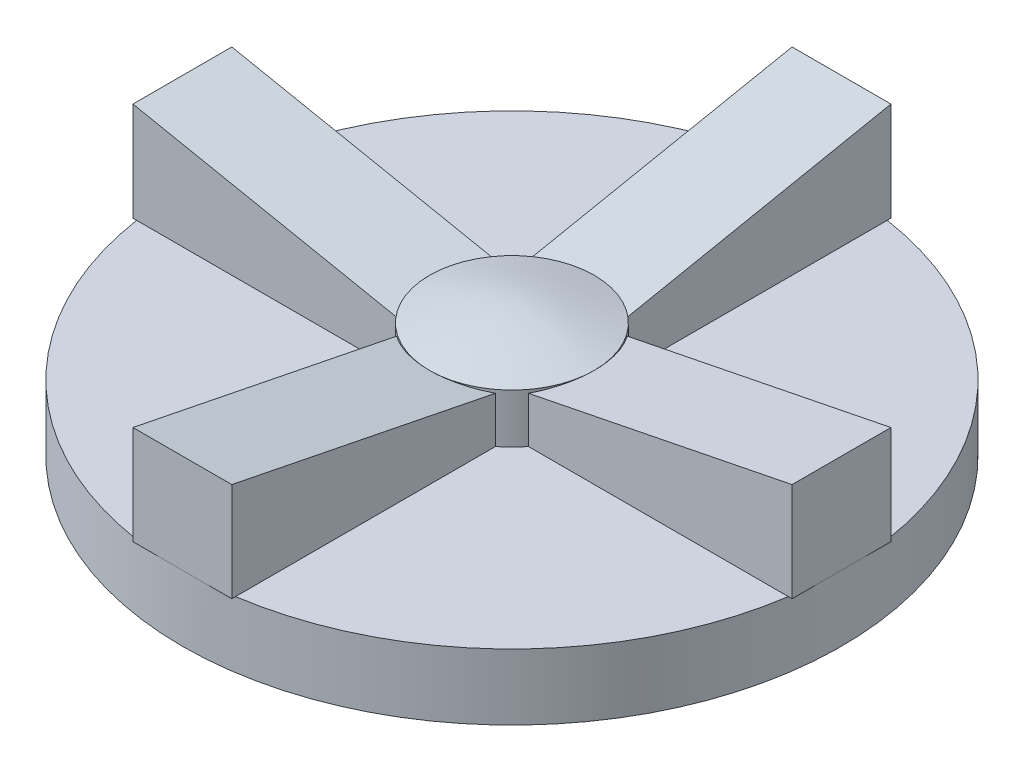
ISO-10303-21;
HEADER;
FILE_DESCRIPTION(('STEP AP214'),'2;1');
FILE_NAME('part.step','',(''),(''),'','','');
FILE_SCHEMA(('AUTOMOTIVE_DESIGN { 1 0 10303 214 1 1 1 1 }'));
ENDSEC;
DATA;
#1=APPLICATION_CONTEXT('core data for automotive mechanical design processes');
#2=APPLICATION_PROTOCOL_DEFINITION('international standard','automotive_design',2000,#1);
#3=PRODUCT_CONTEXT('',#1,'mechanical');
#4=PRODUCT('Part','Part','',(#3));
#5=PRODUCT_RELATED_PRODUCT_CATEGORY('part','',(#4));
#6=PRODUCT_DEFINITION_FORMATION('','',#4);
#7=PRODUCT_DEFINITION_CONTEXT('part definition',#1,'design');
#8=PRODUCT_DEFINITION('design','',#6,#7);
#9=PRODUCT_DEFINITION_SHAPE('','',#8);
#10=(LENGTH_UNIT() NAMED_UNIT(*) SI_UNIT(.MILLI.,.METRE.));
#11=(NAMED_UNIT(*) PLANE_ANGLE_UNIT() SI_UNIT($,.RADIAN.));
#12=(NAMED_UNIT(*) SI_UNIT($,.STERADIAN.) SOLID_ANGLE_UNIT());
#13=UNCERTAINTY_MEASURE_WITH_UNIT(LENGTH_MEASURE(1.E-05),#10,'distance_accuracy_value','');
#14=(GEOMETRIC_REPRESENTATION_CONTEXT(3) GLOBAL_UNCERTAINTY_ASSIGNED_CONTEXT((#13)) GLOBAL_UNIT_ASSIGNED_CONTEXT((#10,
#11,#12)) REPRESENTATION_CONTEXT('',''));
#15=CARTESIAN_POINT('',(0.,0.,0.));
#16=DIRECTION('',(0.,0.,1.));
#17=DIRECTION('',(1.,0.,0.));
#18=AXIS2_PLACEMENT_3D('',#15,#16,#17);
#19=CARTESIAN_POINT('',(0.,4.,0.));
#20=DIRECTION('',(0.,1.,0.));
#21=DIRECTION('',(0.,0.,1.));
#22=AXIS2_PLACEMENT_3D('',#19,#20,#21);
#23=PLANE('',#22);
#24=CARTESIAN_POINT('',(0.,4.,0.));
#25=DIRECTION('',(0.,1.,0.));
#26=DIRECTION('',(0.,0.,1.));
#27=AXIS2_PLACEMENT_3D('',#24,#25,#26);
#28=CIRCLE('',#27,5.);
#29=CARTESIAN_POINT('',(-2.99999999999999,4.,4.00000000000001));
#30=VERTEX_POINT('',#29);
#31=CARTESIAN_POINT('',(-4.,4.,3.));
#32=VERTEX_POINT('',#31);
#33=EDGE_CURVE('E178',#30,#32,#28,.F.);
#34=ORIENTED_EDGE('',*,*,#33,.T.);
#35=DIRECTION('',(1.,0.,0.));
#36=VECTOR('',#35,1.);
#37=CARTESIAN_POINT('',(-20.,4.,3.));
#38=LINE('',#37,#36);
#39=CARTESIAN_POINT('',(-19.7737199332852,4.,3.));
#40=VERTEX_POINT('',#39);
#41=EDGE_CURVE('E402',#40,#32,#38,.T.);
#42=ORIENTED_EDGE('',*,*,#41,.F.);
#43=CARTESIAN_POINT('',(0.,4.,0.));
#44=DIRECTION('',(0.,1.,0.));
#45=DIRECTION('',(0.,0.,1.));
#46=AXIS2_PLACEMENT_3D('',#43,#44,#45);
#47=CIRCLE('',#46,20.);
#48=CARTESIAN_POINT('',(-2.99999999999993,4.,19.7737199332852));
#49=VERTEX_POINT('',#48);
#50=EDGE_CURVE('E559',#40,#49,#47,.T.);
#51=ORIENTED_EDGE('',*,*,#50,.T.);
#52=DIRECTION('',(0.,0.,-1.));
#53=VECTOR('',#52,1.);
#54=CARTESIAN_POINT('',(-2.99999999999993,4.,20.));
#55=LINE('',#54,#53);
#56=EDGE_CURVE('E382',#49,#30,#55,.T.);
#57=ORIENTED_EDGE('',*,*,#56,.T.);
#58=EDGE_LOOP('',(#34,#42,#51,#57));
#59=FACE_BOUND('',#58,.T.);
#60=ADVANCED_FACE('F127',(#59),#23,.T.);
#61=CARTESIAN_POINT('',(-4.,4.,-3.));
#62=VERTEX_POINT('',#61);
#63=CARTESIAN_POINT('',(-3.00000000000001,4.,-3.99999999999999));
#64=VERTEX_POINT('',#63);
#65=EDGE_CURVE('E527',#62,#64,#28,.F.);
#66=ORIENTED_EDGE('',*,*,#65,.T.);
#67=CARTESIAN_POINT('',(-3.00000000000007,4.,-19.7737199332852));
#68=VERTEX_POINT('',#67);
#69=EDGE_CURVE('E383',#64,#68,#55,.T.);
#70=ORIENTED_EDGE('',*,*,#69,.T.);
#71=CARTESIAN_POINT('',(-19.7737199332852,4.,-3.));
#72=VERTEX_POINT('',#71);
#73=EDGE_CURVE('E312',#68,#72,#47,.T.);
#74=ORIENTED_EDGE('',*,*,#73,.T.);
#75=DIRECTION('',(1.,0.,0.));
#76=VECTOR('',#75,1.);
#77=CARTESIAN_POINT('',(-20.,4.,-3.));
#78=LINE('',#77,#76);
#79=EDGE_CURVE('E144',#72,#62,#78,.T.);
#80=ORIENTED_EDGE('',*,*,#79,.T.);
#81=EDGE_LOOP('',(#66,#70,#74,#80));
#82=FACE_BOUND('',#81,.T.);
#83=ADVANCED_FACE('F562',(#82),#23,.T.);
#84=CARTESIAN_POINT('',(4.00000000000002,4.,2.99999999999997));
#85=VERTEX_POINT('',#84);
#86=CARTESIAN_POINT('',(3.00000000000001,4.,3.99999999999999));
#87=VERTEX_POINT('',#86);
#88=EDGE_CURVE('E458',#85,#87,#28,.F.);
#89=ORIENTED_EDGE('',*,*,#88,.T.);
#90=DIRECTION('',(0.,0.,-1.));
#91=VECTOR('',#90,1.);
#92=CARTESIAN_POINT('',(3.00000000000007,4.,20.));
#93=LINE('',#92,#91);
#94=CARTESIAN_POINT('',(3.00000000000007,4.,19.7737199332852));
#95=VERTEX_POINT('',#94);
#96=EDGE_CURVE('E373',#95,#87,#93,.T.);
#97=ORIENTED_EDGE('',*,*,#96,.F.);
#98=CARTESIAN_POINT('',(19.7737199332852,4.,2.99999999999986));
#99=VERTEX_POINT('',#98);
#100=EDGE_CURVE('E576',#95,#99,#47,.T.);
#101=ORIENTED_EDGE('',*,*,#100,.T.);
#102=DIRECTION('',(-1.,0.,0.));
#103=VECTOR('',#102,1.);
#104=CARTESIAN_POINT('',(20.,4.,2.99999999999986));
#105=LINE('',#104,#103);
#106=EDGE_CURVE('E341',#99,#85,#105,.T.);
#107=ORIENTED_EDGE('',*,*,#106,.T.);
#108=EDGE_LOOP('',(#89,#97,#101,#107));
#109=FACE_BOUND('',#108,.T.);
#110=ADVANCED_FACE('F635',(#109),#23,.T.);
#111=CARTESIAN_POINT('',(0.,6.,3.));
#112=DIRECTION('',(-0.196116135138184,-0.98058067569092,0.));
#113=DIRECTION('',(0.98058067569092,-0.196116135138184,0.));
#114=AXIS2_PLACEMENT_3D('',#111,#112,#113);
#115=PLANE('',#114);
#116=CARTESIAN_POINT('',(0.,6.,0.));
#117=DIRECTION('',(-0.196116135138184,-0.98058067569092,0.));
#118=DIRECTION('',(-0.98058067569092,0.196116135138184,0.));
#119=AXIS2_PLACEMENT_3D('',#116,#117,#118);
#120=ELLIPSE('',#119,5.09901951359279,5.);
#121=CARTESIAN_POINT('',(-4.,6.8,3.));
#122=VERTEX_POINT('',#121);
#123=CARTESIAN_POINT('',(-4.99999933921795,7.00013642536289,1.80016049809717E-11));
#124=VERTEX_POINT('',#123);
#125=EDGE_CURVE('E453',#122,#124,#120,.T.);
#126=ORIENTED_EDGE('',*,*,#125,.T.);
#127=CARTESIAN_POINT('',(-4.,6.8,-3.));
#128=VERTEX_POINT('',#127);
#129=EDGE_CURVE('E444',#124,#128,#120,.T.);
#130=ORIENTED_EDGE('',*,*,#129,.T.);
#131=DIRECTION('',(-0.98058067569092,0.196116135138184,0.));
#132=VECTOR('',#131,1.);
#133=CARTESIAN_POINT('',(0.,6.,-3.));
#134=LINE('',#133,#132);
#135=CARTESIAN_POINT('',(-20.,10.,-3.));
#136=VERTEX_POINT('',#135);
#137=EDGE_CURVE('E410',#128,#136,#134,.T.);
#138=ORIENTED_EDGE('',*,*,#137,.T.);
#139=DIRECTION('',(0.,0.,-1.));
#140=VECTOR('',#139,1.);
#141=CARTESIAN_POINT('',(-20.,10.,3.));
#142=LINE('',#141,#140);
#143=CARTESIAN_POINT('',(-20.,10.,3.));
#144=VERTEX_POINT('',#143);
#145=EDGE_CURVE('E417',#144,#136,#142,.T.);
#146=ORIENTED_EDGE('',*,*,#145,.F.);
#147=DIRECTION('',(-0.98058067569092,0.196116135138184,0.));
#148=VECTOR('',#147,1.);
#149=CARTESIAN_POINT('',(0.,6.,3.));
#150=LINE('',#149,#148);
#151=EDGE_CURVE('E400',#122,#144,#150,.T.);
#152=ORIENTED_EDGE('',*,*,#151,.F.);
#153=EDGE_LOOP('',(#126,#130,#138,#146,#152));
#154=FACE_BOUND('',#153,.T.);
#155=ADVANCED_FACE('F495',(#154),#115,.F.);
#156=CARTESIAN_POINT('',(0.,4.,3.));
#157=DIRECTION('',(0.,0.,1.));
#158=DIRECTION('',(1.,0.,0.));
#159=AXIS2_PLACEMENT_3D('',#156,#157,#158);
#160=PLANE('',#159);
#161=DIRECTION('',(0.,1.,0.));
#162=VECTOR('',#161,1.);
#163=CARTESIAN_POINT('',(-4.,-10.142135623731,3.));
#164=LINE('',#163,#162);
#165=EDGE_CURVE('E447',#122,#32,#164,.F.);
#166=ORIENTED_EDGE('',*,*,#165,.F.);
#167=ORIENTED_EDGE('',*,*,#151,.T.);
#168=DIRECTION('',(0.,-1.,0.));
#169=VECTOR('',#168,1.);
#170=CARTESIAN_POINT('',(-20.,10.,3.));
#171=LINE('',#170,#169);
#172=CARTESIAN_POINT('',(-20.,4.,3.));
#173=VERTEX_POINT('',#172);
#174=EDGE_CURVE('E404',#144,#173,#171,.T.);
#175=ORIENTED_EDGE('',*,*,#174,.T.);
#176=EDGE_CURVE('E397',#173,#40,#38,.T.);
#177=ORIENTED_EDGE('',*,*,#176,.T.);
#178=ORIENTED_EDGE('',*,*,#41,.T.);
#179=EDGE_LOOP('',(#166,#167,#175,#177,#178));
#180=FACE_BOUND('',#179,.T.);
#181=ADVANCED_FACE('F500',(#180),#160,.T.);
#182=CARTESIAN_POINT('',(0.,4.,-3.));
#183=DIRECTION('',(0.,0.,1.));
#184=DIRECTION('',(1.,0.,0.));
#185=AXIS2_PLACEMENT_3D('',#182,#183,#184);
#186=PLANE('',#185);
#187=ORIENTED_EDGE('',*,*,#137,.F.);
#188=DIRECTION('',(0.,1.,0.));
#189=VECTOR('',#188,1.);
#190=CARTESIAN_POINT('',(-4.,-10.142135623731,-3.));
#191=LINE('',#190,#189);
#192=EDGE_CURVE('E441',#128,#62,#191,.F.);
#193=ORIENTED_EDGE('',*,*,#192,.T.);
#194=ORIENTED_EDGE('',*,*,#79,.F.);
#195=CARTESIAN_POINT('',(-20.,4.,-3.));
#196=VERTEX_POINT('',#195);
#197=EDGE_CURVE('E407',#196,#72,#78,.T.);
#198=ORIENTED_EDGE('',*,*,#197,.F.);
#199=DIRECTION('',(0.,-1.,0.));
#200=VECTOR('',#199,1.);
#201=CARTESIAN_POINT('',(-20.,10.,-3.));
#202=LINE('',#201,#200);
#203=EDGE_CURVE('E401',#136,#196,#202,.T.);
#204=ORIENTED_EDGE('',*,*,#203,.F.);
#205=EDGE_LOOP('',(#187,#193,#194,#198,#204));
#206=FACE_BOUND('',#205,.T.);
#207=ADVANCED_FACE('F566',(#206),#186,.F.);
#208=CARTESIAN_POINT('',(2.99999999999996,4.,-4.00000000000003));
#209=VERTEX_POINT('',#208);
#210=CARTESIAN_POINT('',(3.99999999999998,4.,-3.00000000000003));
#211=VERTEX_POINT('',#210);
#212=EDGE_CURVE('E153',#209,#211,#28,.F.);
#213=ORIENTED_EDGE('',*,*,#212,.T.);
#214=DIRECTION('',(-1.,0.,0.));
#215=VECTOR('',#214,1.);
#216=CARTESIAN_POINT('',(20.,4.,-3.00000000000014));
#217=LINE('',#216,#215);
#218=CARTESIAN_POINT('',(19.7737199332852,4.,-3.00000000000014));
#219=VERTEX_POINT('',#218);
#220=EDGE_CURVE('E350',#219,#211,#217,.T.);
#221=ORIENTED_EDGE('',*,*,#220,.F.);
#222=CARTESIAN_POINT('',(2.99999999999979,4.,-19.7737199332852));
#223=VERTEX_POINT('',#222);
#224=EDGE_CURVE('E578',#219,#223,#47,.T.);
#225=ORIENTED_EDGE('',*,*,#224,.T.);
#226=DIRECTION('',(0.,0.,1.));
#227=VECTOR('',#226,1.);
#228=CARTESIAN_POINT('',(2.99999999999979,4.,-20.));
#229=LINE('',#228,#227);
#230=EDGE_CURVE('E503',#223,#209,#229,.T.);
#231=ORIENTED_EDGE('',*,*,#230,.T.);
#232=EDGE_LOOP('',(#213,#221,#225,#231));
#233=FACE_BOUND('',#232,.T.);
#234=ADVANCED_FACE('F583',(#233),#23,.T.);
#235=CARTESIAN_POINT('',(0.,4.,0.));
#236=DIRECTION('',(0.,-1.,0.));
#237=DIRECTION('',(0.,0.,-1.));
#238=AXIS2_PLACEMENT_3D('',#235,#236,#237);
#239=CYLINDRICAL_SURFACE('',#238,20.);
#240=CARTESIAN_POINT('',(-20.,4.,0.));
#241=VERTEX_POINT('',#240);
#242=EDGE_CURVE('E421',#72,#241,#47,.T.);
#243=ORIENTED_EDGE('',*,*,#242,.F.);
#244=ORIENTED_EDGE('',*,*,#73,.F.);
#245=CARTESIAN_POINT('',(0.,4.,0.));
#246=DIRECTION('',(0.,1.,0.));
#247=DIRECTION('',(0.,0.,1.));
#248=AXIS2_PLACEMENT_3D('',#245,#246,#247);
#249=CIRCLE('',#248,20.);
#250=CARTESIAN_POINT('',(-2.09489001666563E-13,4.,-20.));
#251=VERTEX_POINT('',#250);
#252=EDGE_CURVE('E304',#251,#68,#249,.T.);
#253=ORIENTED_EDGE('',*,*,#252,.F.);
#254=EDGE_CURVE('E310',#223,#251,#249,.T.);
#255=ORIENTED_EDGE('',*,*,#254,.F.);
#256=ORIENTED_EDGE('',*,*,#224,.F.);
#257=CARTESIAN_POINT('',(20.,4.,-1.39659334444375E-13));
#258=VERTEX_POINT('',#257);
#259=EDGE_CURVE('E326',#258,#219,#249,.T.);
#260=ORIENTED_EDGE('',*,*,#259,.F.);
#261=EDGE_CURVE('E396',#99,#258,#249,.T.);
#262=ORIENTED_EDGE('',*,*,#261,.F.);
#263=ORIENTED_EDGE('',*,*,#100,.F.);
#264=CARTESIAN_POINT('',(0.,4.,20.));
#265=VERTEX_POINT('',#264);
#266=EDGE_CURVE('E316',#265,#95,#249,.T.);
#267=ORIENTED_EDGE('',*,*,#266,.F.);
#268=EDGE_CURVE('E393',#49,#265,#249,.T.);
#269=ORIENTED_EDGE('',*,*,#268,.F.);
#270=ORIENTED_EDGE('',*,*,#50,.F.);
#271=EDGE_CURVE('E424',#241,#40,#47,.T.);
#272=ORIENTED_EDGE('',*,*,#271,.F.);
#273=EDGE_LOOP('',(#243,#244,#253,#255,#256,#260,#262,#263,#267,#269,#270,#272));
#274=FACE_BOUND('',#273,.T.);
#275=CARTESIAN_POINT('',(0.,0.,0.));
#276=DIRECTION('',(0.,1.,0.));
#277=DIRECTION('',(0.,0.,1.));
#278=AXIS2_PLACEMENT_3D('',#275,#276,#277);
#279=CIRCLE('',#278,20.);
#280=CARTESIAN_POINT('',(0.,0.,20.));
#281=VERTEX_POINT('',#280);
#282=EDGE_CURVE('E420',#281,#281,#279,.T.);
#283=ORIENTED_EDGE('',*,*,#282,.T.);
#284=EDGE_LOOP('',(#283));
#285=FACE_BOUND('',#284,.T.);
#286=ADVANCED_FACE('F307',(#274,#285),#239,.T.);
#287=CARTESIAN_POINT('',(0.,0.,0.));
#288=DIRECTION('',(0.,1.,0.));
#289=DIRECTION('',(0.,0.,1.));
#290=AXIS2_PLACEMENT_3D('',#287,#288,#289);
#291=PLANE('',#290);
#292=ORIENTED_EDGE('',*,*,#282,.F.);
#293=EDGE_LOOP('',(#292));
#294=FACE_BOUND('',#293,.T.);
#295=ADVANCED_FACE('F643',(#294),#291,.F.);
#296=CARTESIAN_POINT('',(-20.,4.,3.));
#297=DIRECTION('',(0.,1.,0.));
#298=DIRECTION('',(0.,0.,1.));
#299=AXIS2_PLACEMENT_3D('',#296,#297,#298);
#300=PLANE('',#299);
#301=ORIENTED_EDGE('',*,*,#197,.T.);
#302=ORIENTED_EDGE('',*,*,#242,.T.);
#303=DIRECTION('',(0.,0.,-1.));
#304=VECTOR('',#303,1.);
#305=CARTESIAN_POINT('',(-20.,4.,3.));
#306=LINE('',#305,#304);
#307=EDGE_CURVE('E406',#241,#196,#306,.T.);
#308=ORIENTED_EDGE('',*,*,#307,.T.);
#309=EDGE_LOOP('',(#301,#302,#308));
#310=FACE_BOUND('',#309,.T.);
#311=ADVANCED_FACE('F679',(#310),#300,.F.);
#312=EDGE_CURVE('E414',#173,#241,#306,.T.);
#313=ORIENTED_EDGE('',*,*,#312,.T.);
#314=ORIENTED_EDGE('',*,*,#271,.T.);
#315=ORIENTED_EDGE('',*,*,#176,.F.);
#316=EDGE_LOOP('',(#313,#314,#315));
#317=FACE_BOUND('',#316,.T.);
#318=ADVANCED_FACE('F575',(#317),#300,.F.);
#319=CARTESIAN_POINT('',(-20.,10.,3.));
#320=DIRECTION('',(1.,0.,0.));
#321=DIRECTION('',(0.,1.,0.));
#322=AXIS2_PLACEMENT_3D('',#319,#320,#321);
#323=PLANE('',#322);
#324=ORIENTED_EDGE('',*,*,#203,.T.);
#325=ORIENTED_EDGE('',*,*,#307,.F.);
#326=ORIENTED_EDGE('',*,*,#312,.F.);
#327=ORIENTED_EDGE('',*,*,#174,.F.);
#328=ORIENTED_EDGE('',*,*,#145,.T.);
#329=EDGE_LOOP('',(#324,#325,#326,#327,#328));
#330=FACE_BOUND('',#329,.T.);
#331=ADVANCED_FACE('F570',(#330),#323,.F.);
#332=CARTESIAN_POINT('',(3.,6.,0.));
#333=DIRECTION('',(0.,-0.98058067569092,0.196116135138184));
#334=DIRECTION('',(0.,-0.196116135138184,-0.98058067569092));
#335=AXIS2_PLACEMENT_3D('',#332,#333,#334);
#336=PLANE('',#335);
#337=CARTESIAN_POINT('',(0.,6.,0.));
#338=DIRECTION('',(0.,-0.98058067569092,0.196116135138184));
#339=DIRECTION('',(0.,0.196116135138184,0.98058067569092));
#340=AXIS2_PLACEMENT_3D('',#337,#338,#339);
#341=ELLIPSE('',#340,5.09901951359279,5.);
#342=CARTESIAN_POINT('',(3.00000000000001,6.8,3.99999999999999));
#343=VERTEX_POINT('',#342);
#344=CARTESIAN_POINT('',(0.,7.0001366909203,5.));
#345=VERTEX_POINT('',#344);
#346=EDGE_CURVE('E431',#343,#345,#341,.T.);
#347=ORIENTED_EDGE('',*,*,#346,.T.);
#348=CARTESIAN_POINT('',(-2.99999999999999,6.8,4.00000000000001));
#349=VERTEX_POINT('',#348);
#350=EDGE_CURVE('E427',#345,#349,#341,.T.);
#351=ORIENTED_EDGE('',*,*,#350,.T.);
#352=DIRECTION('',(0.,0.196116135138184,0.98058067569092));
#353=VECTOR('',#352,1.);
#354=CARTESIAN_POINT('',(-3.,6.,0.));
#355=LINE('',#354,#353);
#356=CARTESIAN_POINT('',(-2.99999999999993,10.,20.));
#357=VERTEX_POINT('',#356);
#358=EDGE_CURVE('E381',#349,#357,#355,.T.);
#359=ORIENTED_EDGE('',*,*,#358,.T.);
#360=DIRECTION('',(-1.,0.,0.));
#361=VECTOR('',#360,1.);
#362=CARTESIAN_POINT('',(3.00000000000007,10.,20.));
#363=LINE('',#362,#361);
#364=CARTESIAN_POINT('',(3.00000000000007,10.,20.));
#365=VERTEX_POINT('',#364);
#366=EDGE_CURVE('E391',#365,#357,#363,.T.);
#367=ORIENTED_EDGE('',*,*,#366,.F.);
#368=DIRECTION('',(0.,0.196116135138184,0.98058067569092));
#369=VECTOR('',#368,1.);
#370=CARTESIAN_POINT('',(3.,6.,0.));
#371=LINE('',#370,#369);
#372=EDGE_CURVE('E372',#343,#365,#371,.T.);
#373=ORIENTED_EDGE('',*,*,#372,.F.);
#374=EDGE_LOOP('',(#347,#351,#359,#367,#373));
#375=FACE_BOUND('',#374,.T.);
#376=ADVANCED_FACE('F629',(#375),#336,.F.);
#377=CARTESIAN_POINT('',(3.00000000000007,4.,20.));
#378=DIRECTION('',(0.,1.,0.));
#379=DIRECTION('',(0.,0.,1.));
#380=AXIS2_PLACEMENT_3D('',#377,#378,#379);
#381=PLANE('',#380);
#382=CARTESIAN_POINT('',(20.,4.,2.99999999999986));
#383=VERTEX_POINT('',#382);
#384=EDGE_CURVE('E355',#383,#99,#105,.T.);
#385=ORIENTED_EDGE('',*,*,#384,.T.);
#386=ORIENTED_EDGE('',*,*,#261,.T.);
#387=DIRECTION('',(0.,0.,1.));
#388=VECTOR('',#387,1.);
#389=CARTESIAN_POINT('',(20.,4.,-3.00000000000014));
#390=LINE('',#389,#388);
#391=EDGE_CURVE('E354',#258,#383,#390,.T.);
#392=ORIENTED_EDGE('',*,*,#391,.T.);
#393=EDGE_LOOP('',(#385,#386,#392));
#394=FACE_BOUND('',#393,.T.);
#395=ADVANCED_FACE('F601',(#394),#381,.F.);
#396=CARTESIAN_POINT('',(20.,4.,-3.00000000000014));
#397=VERTEX_POINT('',#396);
#398=EDGE_CURVE('E363',#397,#258,#390,.T.);
#399=ORIENTED_EDGE('',*,*,#398,.T.);
#400=ORIENTED_EDGE('',*,*,#259,.T.);
#401=EDGE_CURVE('E346',#397,#219,#217,.T.);
#402=ORIENTED_EDGE('',*,*,#401,.F.);
#403=EDGE_LOOP('',(#399,#400,#402));
#404=FACE_BOUND('',#403,.T.);
#405=ADVANCED_FACE('F589',(#404),#381,.F.);
#406=CARTESIAN_POINT('',(2.99999999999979,4.,-20.));
#407=VERTEX_POINT('',#406);
#408=EDGE_CURVE('E325',#407,#223,#229,.T.);
#409=ORIENTED_EDGE('',*,*,#408,.T.);
#410=ORIENTED_EDGE('',*,*,#254,.T.);
#411=DIRECTION('',(1.,0.,0.));
#412=VECTOR('',#411,1.);
#413=CARTESIAN_POINT('',(-3.00000000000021,4.,-20.));
#414=LINE('',#413,#412);
#415=EDGE_CURVE('E322',#251,#407,#414,.T.);
#416=ORIENTED_EDGE('',*,*,#415,.T.);
#417=EDGE_LOOP('',(#409,#410,#416));
#418=FACE_BOUND('',#417,.T.);
#419=ADVANCED_FACE('F321',(#418),#381,.F.);
#420=CARTESIAN_POINT('',(-3.00000000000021,4.,-20.));
#421=VERTEX_POINT('',#420);
#422=EDGE_CURVE('E331',#421,#251,#414,.T.);
#423=ORIENTED_EDGE('',*,*,#422,.T.);
#424=ORIENTED_EDGE('',*,*,#252,.T.);
#425=EDGE_CURVE('E338',#68,#421,#55,.T.);
#426=ORIENTED_EDGE('',*,*,#425,.T.);
#427=EDGE_LOOP('',(#423,#424,#426));
#428=FACE_BOUND('',#427,.T.);
#429=ADVANCED_FACE('F337',(#428),#381,.F.);
#430=DIRECTION('',(-1.,0.,0.));
#431=VECTOR('',#430,1.);
#432=CARTESIAN_POINT('',(3.00000000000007,4.,20.));
#433=LINE('',#432,#431);
#434=CARTESIAN_POINT('',(3.00000000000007,4.,20.));
#435=VERTEX_POINT('',#434);
#436=EDGE_CURVE('E388',#435,#265,#433,.T.);
#437=ORIENTED_EDGE('',*,*,#436,.T.);
#438=ORIENTED_EDGE('',*,*,#266,.T.);
#439=EDGE_CURVE('E369',#435,#95,#93,.T.);
#440=ORIENTED_EDGE('',*,*,#439,.F.);
#441=EDGE_LOOP('',(#437,#438,#440));
#442=FACE_BOUND('',#441,.T.);
#443=ADVANCED_FACE('F605',(#442),#381,.F.);
#444=CARTESIAN_POINT('',(-2.99999999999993,4.,20.));
#445=VERTEX_POINT('',#444);
#446=EDGE_CURVE('E378',#445,#49,#55,.T.);
#447=ORIENTED_EDGE('',*,*,#446,.T.);
#448=ORIENTED_EDGE('',*,*,#268,.T.);
#449=EDGE_CURVE('E377',#265,#445,#433,.T.);
#450=ORIENTED_EDGE('',*,*,#449,.T.);
#451=EDGE_LOOP('',(#447,#448,#450));
#452=FACE_BOUND('',#451,.T.);
#453=ADVANCED_FACE('F618',(#452),#381,.F.);
#454=CARTESIAN_POINT('',(-3.,4.,0.));
#455=DIRECTION('',(1.,0.,0.));
#456=DIRECTION('',(0.,0.,-1.));
#457=AXIS2_PLACEMENT_3D('',#454,#455,#456);
#458=PLANE('',#457);
#459=ORIENTED_EDGE('',*,*,#69,.F.);
#460=DIRECTION('',(0.,1.,0.));
#461=VECTOR('',#460,1.);
#462=CARTESIAN_POINT('',(-3.00000000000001,-10.142135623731,-3.99999999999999));
#463=LINE('',#462,#461);
#464=CARTESIAN_POINT('',(-3.00000000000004,6.8,-3.99999999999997));
#465=VERTEX_POINT('',#464);
#466=EDGE_CURVE('E526',#64,#465,#463,.T.);
#467=ORIENTED_EDGE('',*,*,#466,.T.);
#468=DIRECTION('',(0.,0.196116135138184,-0.98058067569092));
#469=VECTOR('',#468,1.);
#470=CARTESIAN_POINT('',(-3.,6.,0.));
#471=LINE('',#470,#469);
#472=CARTESIAN_POINT('',(-3.00000000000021,10.,-20.));
#473=VERTEX_POINT('',#472);
#474=EDGE_CURVE('E514',#465,#473,#471,.T.);
#475=ORIENTED_EDGE('',*,*,#474,.T.);
#476=DIRECTION('',(0.,-1.,0.));
#477=VECTOR('',#476,1.);
#478=CARTESIAN_POINT('',(-3.00000000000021,10.,-20.));
#479=LINE('',#478,#477);
#480=EDGE_CURVE('E335',#473,#421,#479,.T.);
#481=ORIENTED_EDGE('',*,*,#480,.T.);
#482=ORIENTED_EDGE('',*,*,#425,.F.);
#483=EDGE_LOOP('',(#459,#467,#475,#481,#482));
#484=FACE_BOUND('',#483,.T.);
#485=ADVANCED_FACE('F519',(#484),#458,.F.);
#486=CARTESIAN_POINT('',(-3.,6.,0.));
#487=DIRECTION('',(0.,-0.98058067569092,-0.196116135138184));
#488=DIRECTION('',(0.,0.196116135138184,-0.98058067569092));
#489=AXIS2_PLACEMENT_3D('',#486,#487,#488);
#490=PLANE('',#489);
#491=CARTESIAN_POINT('',(0.,6.,0.));
#492=DIRECTION('',(0.,-0.98058067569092,-0.196116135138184));
#493=DIRECTION('',(0.,0.196116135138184,-0.98058067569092));
#494=AXIS2_PLACEMENT_3D('',#491,#492,#493);
#495=ELLIPSE('',#494,5.09901951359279,5.);
#496=CARTESIAN_POINT('',(-1.80498655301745E-11,7.00013642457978,-4.99999933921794));
#497=VERTEX_POINT('',#496);
#498=EDGE_CURVE('E524',#465,#497,#495,.T.);
#499=ORIENTED_EDGE('',*,*,#498,.T.);
#500=CARTESIAN_POINT('',(2.99999999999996,6.8,-4.00000000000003));
#501=VERTEX_POINT('',#500);
#502=EDGE_CURVE('E521',#497,#501,#495,.T.);
#503=ORIENTED_EDGE('',*,*,#502,.T.);
#504=DIRECTION('',(0.,0.196116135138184,-0.98058067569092));
#505=VECTOR('',#504,1.);
#506=CARTESIAN_POINT('',(3.,6.,0.));
#507=LINE('',#506,#505);
#508=CARTESIAN_POINT('',(2.99999999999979,10.,-20.));
#509=VERTEX_POINT('',#508);
#510=EDGE_CURVE('E508',#501,#509,#507,.T.);
#511=ORIENTED_EDGE('',*,*,#510,.T.);
#512=DIRECTION('',(1.,0.,0.));
#513=VECTOR('',#512,1.);
#514=CARTESIAN_POINT('',(-3.00000000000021,10.,-20.));
#515=LINE('',#514,#513);
#516=EDGE_CURVE('E340',#473,#509,#515,.T.);
#517=ORIENTED_EDGE('',*,*,#516,.F.);
#518=ORIENTED_EDGE('',*,*,#474,.F.);
#519=EDGE_LOOP('',(#499,#503,#511,#517,#518));
#520=FACE_BOUND('',#519,.T.);
#521=ADVANCED_FACE('F523',(#520),#490,.F.);
#522=CARTESIAN_POINT('',(3.,4.,0.));
#523=DIRECTION('',(1.,0.,0.));
#524=DIRECTION('',(0.,0.,-1.));
#525=AXIS2_PLACEMENT_3D('',#522,#523,#524);
#526=PLANE('',#525);
#527=DIRECTION('',(0.,1.,0.));
#528=VECTOR('',#527,1.);
#529=CARTESIAN_POINT('',(3.00000000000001,-10.142135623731,3.99999999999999));
#530=LINE('',#529,#528);
#531=EDGE_CURVE('E438',#343,#87,#530,.F.);
#532=ORIENTED_EDGE('',*,*,#531,.F.);
#533=ORIENTED_EDGE('',*,*,#372,.T.);
#534=DIRECTION('',(0.,-1.,0.));
#535=VECTOR('',#534,1.);
#536=CARTESIAN_POINT('',(3.00000000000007,10.,20.));
#537=LINE('',#536,#535);
#538=EDGE_CURVE('E375',#365,#435,#537,.T.);
#539=ORIENTED_EDGE('',*,*,#538,.T.);
#540=ORIENTED_EDGE('',*,*,#439,.T.);
#541=ORIENTED_EDGE('',*,*,#96,.T.);
#542=EDGE_LOOP('',(#532,#533,#539,#540,#541));
#543=FACE_BOUND('',#542,.T.);
#544=ADVANCED_FACE('F610',(#543),#526,.T.);
#545=CARTESIAN_POINT('',(3.00000000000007,10.,20.));
#546=DIRECTION('',(0.,0.,-1.));
#547=DIRECTION('',(-1.,0.,0.));
#548=AXIS2_PLACEMENT_3D('',#545,#546,#547);
#549=PLANE('',#548);
#550=DIRECTION('',(0.,-1.,0.));
#551=VECTOR('',#550,1.);
#552=CARTESIAN_POINT('',(-2.99999999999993,10.,20.));
#553=LINE('',#552,#551);
#554=EDGE_CURVE('E385',#357,#445,#553,.T.);
#555=ORIENTED_EDGE('',*,*,#554,.T.);
#556=ORIENTED_EDGE('',*,*,#449,.F.);
#557=ORIENTED_EDGE('',*,*,#436,.F.);
#558=ORIENTED_EDGE('',*,*,#538,.F.);
#559=ORIENTED_EDGE('',*,*,#366,.T.);
#560=EDGE_LOOP('',(#555,#556,#557,#558,#559));
#561=FACE_BOUND('',#560,.T.);
#562=ADVANCED_FACE('F616',(#561),#549,.F.);
#563=ORIENTED_EDGE('',*,*,#358,.F.);
#564=DIRECTION('',(0.,1.,0.));
#565=VECTOR('',#564,1.);
#566=CARTESIAN_POINT('',(-2.99999999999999,-10.142135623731,4.00000000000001));
#567=LINE('',#566,#565);
#568=EDGE_CURVE('E432',#349,#30,#567,.F.);
#569=ORIENTED_EDGE('',*,*,#568,.T.);
#570=ORIENTED_EDGE('',*,*,#56,.F.);
#571=ORIENTED_EDGE('',*,*,#446,.F.);
#572=ORIENTED_EDGE('',*,*,#554,.F.);
#573=EDGE_LOOP('',(#563,#569,#570,#571,#572));
#574=FACE_BOUND('',#573,.T.);
#575=ADVANCED_FACE('F553',(#574),#458,.F.);
#576=CARTESIAN_POINT('',(0.,6.,-3.));
#577=DIRECTION('',(0.196116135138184,-0.98058067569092,0.));
#578=DIRECTION('',(0.98058067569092,0.196116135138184,0.));
#579=AXIS2_PLACEMENT_3D('',#576,#577,#578);
#580=PLANE('',#579);
#581=CARTESIAN_POINT('',(0.,6.,0.));
#582=DIRECTION('',(0.196116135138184,-0.98058067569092,0.));
#583=DIRECTION('',(0.98058067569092,0.196116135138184,0.));
#584=AXIS2_PLACEMENT_3D('',#581,#582,#583);
#585=ELLIPSE('',#584,5.09901951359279,5.);
#586=CARTESIAN_POINT('',(3.99999999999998,6.8,-3.00000000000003));
#587=VERTEX_POINT('',#586);
#588=CARTESIAN_POINT('',(4.9999993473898,7.00013650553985,-1.75844039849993E-11));
#589=VERTEX_POINT('',#588);
#590=EDGE_CURVE('E531',#587,#589,#585,.T.);
#591=ORIENTED_EDGE('',*,*,#590,.T.);
#592=CARTESIAN_POINT('',(4.00000000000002,6.8,2.99999999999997));
#593=VERTEX_POINT('',#592);
#594=EDGE_CURVE('E539',#589,#593,#585,.T.);
#595=ORIENTED_EDGE('',*,*,#594,.T.);
#596=DIRECTION('',(0.98058067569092,0.196116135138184,0.));
#597=VECTOR('',#596,1.);
#598=CARTESIAN_POINT('',(0.,6.,3.));
#599=LINE('',#598,#597);
#600=CARTESIAN_POINT('',(20.,10.,2.99999999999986));
#601=VERTEX_POINT('',#600);
#602=EDGE_CURVE('E358',#593,#601,#599,.T.);
#603=ORIENTED_EDGE('',*,*,#602,.T.);
#604=DIRECTION('',(0.,0.,1.));
#605=VECTOR('',#604,1.);
#606=CARTESIAN_POINT('',(20.,10.,-3.00000000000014));
#607=LINE('',#606,#605);
#608=CARTESIAN_POINT('',(20.,10.,-3.00000000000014));
#609=VERTEX_POINT('',#608);
#610=EDGE_CURVE('E366',#609,#601,#607,.T.);
#611=ORIENTED_EDGE('',*,*,#610,.F.);
#612=DIRECTION('',(0.98058067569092,0.196116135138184,0.));
#613=VECTOR('',#612,1.);
#614=CARTESIAN_POINT('',(0.,6.,-3.));
#615=LINE('',#614,#613);
#616=EDGE_CURVE('E349',#587,#609,#615,.T.);
#617=ORIENTED_EDGE('',*,*,#616,.F.);
#618=EDGE_LOOP('',(#591,#595,#603,#611,#617));
#619=FACE_BOUND('',#618,.T.);
#620=ADVANCED_FACE('F655',(#619),#580,.F.);
#621=CARTESIAN_POINT('',(0.,4.,-3.));
#622=DIRECTION('',(0.,0.,-1.));
#623=DIRECTION('',(-1.,0.,0.));
#624=AXIS2_PLACEMENT_3D('',#621,#622,#623);
#625=PLANE('',#624);
#626=DIRECTION('',(0.,1.,0.));
#627=VECTOR('',#626,1.);
#628=CARTESIAN_POINT('',(3.99999999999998,-10.142135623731,-3.00000000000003));
#629=LINE('',#628,#627);
#630=EDGE_CURVE('E541',#587,#211,#629,.F.);
#631=ORIENTED_EDGE('',*,*,#630,.F.);
#632=ORIENTED_EDGE('',*,*,#616,.T.);
#633=DIRECTION('',(0.,-1.,0.));
#634=VECTOR('',#633,1.);
#635=CARTESIAN_POINT('',(20.,10.,-3.00000000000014));
#636=LINE('',#635,#634);
#637=EDGE_CURVE('E352',#609,#397,#636,.T.);
#638=ORIENTED_EDGE('',*,*,#637,.T.);
#639=ORIENTED_EDGE('',*,*,#401,.T.);
#640=ORIENTED_EDGE('',*,*,#220,.T.);
#641=EDGE_LOOP('',(#631,#632,#638,#639,#640));
#642=FACE_BOUND('',#641,.T.);
#643=ADVANCED_FACE('F592',(#642),#625,.T.);
#644=CARTESIAN_POINT('',(20.,10.,-3.00000000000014));
#645=DIRECTION('',(-1.,0.,0.));
#646=DIRECTION('',(0.,0.,1.));
#647=AXIS2_PLACEMENT_3D('',#644,#645,#646);
#648=PLANE('',#647);
#649=DIRECTION('',(0.,-1.,0.));
#650=VECTOR('',#649,1.);
#651=CARTESIAN_POINT('',(20.,10.,2.99999999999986));
#652=LINE('',#651,#650);
#653=EDGE_CURVE('E360',#601,#383,#652,.T.);
#654=ORIENTED_EDGE('',*,*,#653,.T.);
#655=ORIENTED_EDGE('',*,*,#391,.F.);
#656=ORIENTED_EDGE('',*,*,#398,.F.);
#657=ORIENTED_EDGE('',*,*,#637,.F.);
#658=ORIENTED_EDGE('',*,*,#610,.T.);
#659=EDGE_LOOP('',(#654,#655,#656,#657,#658));
#660=FACE_BOUND('',#659,.T.);
#661=ADVANCED_FACE('F597',(#660),#648,.F.);
#662=CARTESIAN_POINT('',(0.,4.,3.));
#663=DIRECTION('',(0.,0.,-1.));
#664=DIRECTION('',(-1.,0.,0.));
#665=AXIS2_PLACEMENT_3D('',#662,#663,#664);
#666=PLANE('',#665);
#667=ORIENTED_EDGE('',*,*,#602,.F.);
#668=DIRECTION('',(0.,1.,0.));
#669=VECTOR('',#668,1.);
#670=CARTESIAN_POINT('',(4.00000000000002,-10.142135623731,2.99999999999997));
#671=LINE('',#670,#669);
#672=EDGE_CURVE('E537',#593,#85,#671,.F.);
#673=ORIENTED_EDGE('',*,*,#672,.T.);
#674=ORIENTED_EDGE('',*,*,#106,.F.);
#675=ORIENTED_EDGE('',*,*,#384,.F.);
#676=ORIENTED_EDGE('',*,*,#653,.F.);
#677=EDGE_LOOP('',(#667,#673,#674,#675,#676));
#678=FACE_BOUND('',#677,.T.);
#679=ADVANCED_FACE('F654',(#678),#666,.F.);
#680=CARTESIAN_POINT('',(-3.00000000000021,10.,-20.));
#681=DIRECTION('',(0.,0.,1.));
#682=DIRECTION('',(1.,0.,0.));
#683=AXIS2_PLACEMENT_3D('',#680,#681,#682);
#684=PLANE('',#683);
#685=DIRECTION('',(0.,-1.,0.));
#686=VECTOR('',#685,1.);
#687=CARTESIAN_POINT('',(2.99999999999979,10.,-20.));
#688=LINE('',#687,#686);
#689=EDGE_CURVE('E334',#509,#407,#688,.T.);
#690=ORIENTED_EDGE('',*,*,#689,.T.);
#691=ORIENTED_EDGE('',*,*,#415,.F.);
#692=ORIENTED_EDGE('',*,*,#422,.F.);
#693=ORIENTED_EDGE('',*,*,#480,.F.);
#694=ORIENTED_EDGE('',*,*,#516,.T.);
#695=EDGE_LOOP('',(#690,#691,#692,#693,#694));
#696=FACE_BOUND('',#695,.T.);
#697=ADVANCED_FACE('F329',(#696),#684,.F.);
#698=CARTESIAN_POINT('',(3.,4.,0.));
#699=DIRECTION('',(-1.,0.,0.));
#700=DIRECTION('',(0.,0.,1.));
#701=AXIS2_PLACEMENT_3D('',#698,#699,#700);
#702=PLANE('',#701);
#703=ORIENTED_EDGE('',*,*,#510,.F.);
#704=DIRECTION('',(0.,1.,0.));
#705=VECTOR('',#704,1.);
#706=CARTESIAN_POINT('',(2.99999999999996,-10.142135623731,-4.00000000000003));
#707=LINE('',#706,#705);
#708=EDGE_CURVE('E13',#501,#209,#707,.F.);
#709=ORIENTED_EDGE('',*,*,#708,.T.);
#710=ORIENTED_EDGE('',*,*,#230,.F.);
#711=ORIENTED_EDGE('',*,*,#408,.F.);
#712=ORIENTED_EDGE('',*,*,#689,.F.);
#713=EDGE_LOOP('',(#703,#709,#710,#711,#712));
#714=FACE_BOUND('',#713,.T.);
#715=ADVANCED_FACE('F470',(#714),#702,.F.);
#716=CARTESIAN_POINT('',(0.,-10.142135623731,0.));
#717=DIRECTION('',(0.,1.,0.));
#718=DIRECTION('',(0.,0.,1.));
#719=AXIS2_PLACEMENT_3D('',#716,#717,#718);
#720=CYLINDRICAL_SURFACE('',#719,5.);
#721=ORIENTED_EDGE('',*,*,#129,.F.);
#722=CARTESIAN_POINT('',(-1.80518441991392E-11,7.00013623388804,-5.));
#723=CARTESIAN_POINT('',(-0.140630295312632,7.00013297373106,-5.00001512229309));
#724=CARTESIAN_POINT('',(-0.281258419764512,7.00014195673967,-4.99406757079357));
#725=CARTESIAN_POINT('',(-0.561508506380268,7.00016247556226,-4.97035634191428));
#726=CARTESIAN_POINT('',(-0.701130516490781,7.00017401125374,-4.95259323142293));
#727=CARTESIAN_POINT('',(-0.978275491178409,7.0001777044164,-4.90537793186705));
#728=CARTESIAN_POINT('',(-1.1157999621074,7.00016987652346,-4.8759345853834));
#729=CARTESIAN_POINT('',(-1.38787951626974,7.00014786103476,-4.80557299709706));
#730=CARTESIAN_POINT('',(-1.52243463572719,7.00013367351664,-4.76465489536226));
#731=CARTESIAN_POINT('',(-1.78766147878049,7.00011707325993,-4.67161893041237));
#732=CARTESIAN_POINT('',(-1.91833201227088,7.00011466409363,-4.61949767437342));
#733=CARTESIAN_POINT('',(-2.17486558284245,7.00011517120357,-4.50441231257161));
#734=CARTESIAN_POINT('',(-2.30072683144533,7.00011808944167,-4.44144422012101));
#735=CARTESIAN_POINT('',(-2.54662988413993,7.00012375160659,-4.30516271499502));
#736=CARTESIAN_POINT('',(-2.6666747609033,7.00012649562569,-4.23185484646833));
#737=CARTESIAN_POINT('',(-2.90020465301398,7.0001297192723,-4.07536211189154));
#738=CARTESIAN_POINT('',(-3.01368737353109,7.00013019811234,-3.99217382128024));
#739=CARTESIAN_POINT('',(-3.23322058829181,7.00013025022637,-3.81654828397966));
#740=CARTESIAN_POINT('',(-3.33927244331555,7.00012982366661,-3.72411273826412));
#741=CARTESIAN_POINT('',(-3.54321303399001,7.00012956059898,-3.53063699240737));
#742=CARTESIAN_POINT('',(-3.64110176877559,7.00012972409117,-3.4295967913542));
#743=CARTESIAN_POINT('',(-3.82805488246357,7.00013023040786,-3.2195910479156));
#744=CARTESIAN_POINT('',(-3.91711598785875,7.00013057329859,-3.11062259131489));
#745=CARTESIAN_POINT('',(-4.08570989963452,7.00012964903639,-2.88560770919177));
#746=CARTESIAN_POINT('',(-4.16524600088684,7.00012838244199,-2.76956375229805));
#747=CARTESIAN_POINT('',(-4.31430160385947,7.0001237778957,-2.53112228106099));
#748=CARTESIAN_POINT('',(-4.38381555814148,7.00012043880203,-2.40872129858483));
#749=CARTESIAN_POINT('',(-4.51225642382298,7.0001155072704,-2.15854301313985));
#750=CARTESIAN_POINT('',(-4.57118717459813,7.00011391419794,-2.03076768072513));
#751=CARTESIAN_POINT('',(-4.67805891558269,7.00011842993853,-1.77073817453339));
#752=CARTESIAN_POINT('',(-4.72600304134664,7.00012453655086,-1.63848529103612));
#753=CARTESIAN_POINT('',(-4.81057015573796,7.00014751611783,-1.37046330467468));
#754=CARTESIAN_POINT('',(-4.8471958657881,7.00016438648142,-1.23469505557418));
#755=CARTESIAN_POINT('',(-4.91855125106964,7.00018048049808,-0.917536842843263));
#756=CARTESIAN_POINT('',(-4.94909352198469,7.00017252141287,-0.735177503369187));
#757=CARTESIAN_POINT('',(-4.97963384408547,7.0001552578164,-0.460174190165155));
#758=CARTESIAN_POINT('',(-4.98726843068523,7.00014862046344,-0.368308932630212));
#759=CARTESIAN_POINT('',(-4.99745087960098,7.00013866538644,-0.184303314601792));
#760=CARTESIAN_POINT('',(-4.99999909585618,7.00013534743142,-0.0921629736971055));
#761=CARTESIAN_POINT('',(-5.,7.00013623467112,1.80043696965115E-11));
#762=B_SPLINE_CURVE_WITH_KNOTS('',3,(#722,#723,#724,#725,#726,#727,#728,#729,#730,#731,#732,
#733,#734,#735,#736,#737,#738,#739,#740,#741,#742,#743,#744,#745,#746,#747,#748,#749,#750,#751,
#752,#753,#754,#755,#756,#757,#758,#759,#760,#761),.UNSPECIFIED.,.F.,.F.,(4,2,2,2,2,2,2,2,2,2,2,
2,2,2,2,2,2,2,2,4),(0.,0.421762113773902,0.843503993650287,1.26492719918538,1.68634526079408,
2.10789112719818,2.5295922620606,2.95106813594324,3.37269052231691,3.79423549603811,
4.21578051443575,4.63748127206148,5.05903573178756,5.48082264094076,5.90245622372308,
6.32396932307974,6.74538099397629,7.29879228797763,7.57522005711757,7.85162859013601),.UNSPECIFIED.);
#763=EDGE_CURVE('E169',#497,#124,#762,.T.);
#764=ORIENTED_EDGE('',*,*,#763,.F.);
#765=ORIENTED_EDGE('',*,*,#498,.F.);
#766=ORIENTED_EDGE('',*,*,#466,.F.);
#767=ORIENTED_EDGE('',*,*,#65,.F.);
#768=ORIENTED_EDGE('',*,*,#192,.F.);
#769=EDGE_LOOP('',(#721,#764,#765,#766,#767,#768));
#770=FACE_BOUND('',#769,.T.);
#771=ADVANCED_FACE('F465',(#770),#720,.T.);
#772=ORIENTED_EDGE('',*,*,#125,.F.);
#773=ORIENTED_EDGE('',*,*,#165,.T.);
#774=ORIENTED_EDGE('',*,*,#33,.F.);
#775=ORIENTED_EDGE('',*,*,#568,.F.);
#776=ORIENTED_EDGE('',*,*,#350,.F.);
#777=CARTESIAN_POINT('',(-5.,7.00013623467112,1.80038411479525E-11));
#778=CARTESIAN_POINT('',(-5.0000151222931,7.00013297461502,0.140630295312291));
#779=CARTESIAN_POINT('',(-4.9940675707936,7.00014195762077,0.281258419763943));
#780=CARTESIAN_POINT('',(-4.9703563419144,7.00016247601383,0.561508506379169));
#781=CARTESIAN_POINT('',(-4.95259323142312,7.00017401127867,0.70113051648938));
#782=CARTESIAN_POINT('',(-4.90537793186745,7.00017770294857,0.978275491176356));
#783=CARTESIAN_POINT('',(-4.87593458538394,7.00016987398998,1.11579996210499));
#784=CARTESIAN_POINT('',(-4.80557299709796,7.00014785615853,1.38787951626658));
#785=CARTESIAN_POINT('',(-4.76465489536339,7.00013366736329,1.52243463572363));
#786=CARTESIAN_POINT('',(-4.67161893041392,7.00011706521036,1.78766147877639));
#787=CARTESIAN_POINT('',(-4.61949767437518,7.00011465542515,1.91833201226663));
#788=CARTESIAN_POINT('',(-4.50441231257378,7.00011516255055,2.17486558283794));
#789=CARTESIAN_POINT('',(-4.44144422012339,7.00011808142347,2.30072683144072));
#790=CARTESIAN_POINT('',(-4.30516271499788,7.0001237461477,2.54662988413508));
#791=CARTESIAN_POINT('',(-4.23185484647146,7.00012649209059,2.66667476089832));
#792=CARTESIAN_POINT('',(-4.07536211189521,7.00012972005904,2.90020465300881));
#793=CARTESIAN_POINT('',(-3.9921738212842,7.00013020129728,3.01368737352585));
#794=CARTESIAN_POINT('',(-3.81654828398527,7.00013025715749,3.2332205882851));
#795=CARTESIAN_POINT('',(-3.72411273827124,7.0001298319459,3.33927244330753));
#796=CARTESIAN_POINT('',(-3.53063699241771,7.00012956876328,3.54321303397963));
#797=CARTESIAN_POINT('',(-3.42959679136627,7.0001297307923,3.64110176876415));
#798=CARTESIAN_POINT('',(-3.21959104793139,7.00013022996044,3.82805488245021));
#799=CARTESIAN_POINT('',(-3.11062259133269,7.00013056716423,3.91711598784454));
#800=CARTESIAN_POINT('',(-2.88560770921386,7.00012962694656,4.08570989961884));
#801=CARTESIAN_POINT('',(-2.76956375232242,7.00012835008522,4.16524600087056));
#802=CARTESIAN_POINT('',(-2.53112228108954,7.00012372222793,4.31430160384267));
#803=CARTESIAN_POINT('',(-2.40872129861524,7.00012037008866,4.3838155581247));
#804=CARTESIAN_POINT('',(-2.1585430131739,7.00011541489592,4.51225642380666));
#805=CARTESIAN_POINT('',(-2.03076768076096,7.00011381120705,4.57118717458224));
#806=CARTESIAN_POINT('',(-1.77073817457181,7.00011831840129,4.67805891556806));
#807=CARTESIAN_POINT('',(-1.63848529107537,7.00012442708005,4.72600304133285));
#808=CARTESIAN_POINT('',(-1.37046330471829,7.00014743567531,4.81057015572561));
#809=CARTESIAN_POINT('',(-1.23469505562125,7.00016433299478,4.84719586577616));
#810=CARTESIAN_POINT('',(-0.917536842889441,7.00018054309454,4.91855125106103));
#811=CARTESIAN_POINT('',(-0.735177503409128,7.00017268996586,4.94909352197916));
#812=CARTESIAN_POINT('',(-0.460174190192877,7.00015557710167,4.97963384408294));
#813=CARTESIAN_POINT('',(-0.368308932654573,7.00014898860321,4.98726843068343));
#814=CARTESIAN_POINT('',(-0.184303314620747,7.0001391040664,4.99745087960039));
#815=CARTESIAN_POINT('',(-0.0921629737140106,7.00013580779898,4.99999909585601));
#816=CARTESIAN_POINT('',(0.,7.0001366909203,5.));
#817=B_SPLINE_CURVE_WITH_KNOTS('',3,(#777,#778,#779,#780,#781,#782,#783,#784,#785,#786,#787,
#788,#789,#790,#791,#792,#793,#794,#795,#796,#797,#798,#799,#800,#801,#802,#803,#804,#805,#806,
#807,#808,#809,#810,#811,#812,#813,#814,#815,#816),.UNSPECIFIED.,.F.,.F.,(4,2,2,2,2,2,2,2,2,2,2,
2,2,2,2,2,2,2,2,4),(0.,0.421762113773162,0.843503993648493,1.2649271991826,1.68634526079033,
2.10789112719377,2.52959226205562,2.95106813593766,3.37269052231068,3.79423549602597,
4.21578051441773,4.63748127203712,5.0590357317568,5.48082264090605,5.90245622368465,
6.3239693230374,6.74538099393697,7.29879228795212,7.57522005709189,7.85162859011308),.UNSPECIFIED.);
#818=EDGE_CURVE('E487',#124,#345,#817,.T.);
#819=ORIENTED_EDGE('',*,*,#818,.F.);
#820=EDGE_LOOP('',(#772,#773,#774,#775,#776,#819));
#821=FACE_BOUND('',#820,.T.);
#822=ADVANCED_FACE('F469',(#821),#720,.T.);
#823=ORIENTED_EDGE('',*,*,#346,.F.);
#824=ORIENTED_EDGE('',*,*,#531,.T.);
#825=ORIENTED_EDGE('',*,*,#88,.F.);
#826=ORIENTED_EDGE('',*,*,#672,.F.);
#827=ORIENTED_EDGE('',*,*,#594,.F.);
#828=CARTESIAN_POINT('',(0.,7.0001366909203,5.));
#829=CARTESIAN_POINT('',(0.140630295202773,7.00013342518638,5.0000151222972));
#830=CARTESIAN_POINT('',(0.281258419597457,7.0001423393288,4.99406757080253));
#831=CARTESIAN_POINT('',(0.561508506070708,7.00016253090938,4.97035634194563));
#832=CARTESIAN_POINT('',(0.701130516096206,7.00017380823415,4.95259323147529));
#833=CARTESIAN_POINT('',(0.978275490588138,7.00017673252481,4.90537793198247));
#834=CARTESIAN_POINT('',(1.11579996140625,7.00016839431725,4.87593458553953));
#835=CARTESIAN_POINT('',(1.3878795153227,7.00014529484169,4.80557299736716));
#836=CARTESIAN_POINT('',(1.52243463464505,7.0001305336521,4.76465489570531));
#837=CARTESIAN_POINT('',(1.7876614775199,7.00011301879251,4.67161893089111));
#838=CARTESIAN_POINT('',(1.91833201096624,7.00011026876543,4.61949767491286));
#839=CARTESIAN_POINT('',(2.1748655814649,7.00011044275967,4.50441231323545));
#840=CARTESIAN_POINT('',(2.30072683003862,7.00011336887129,4.44144422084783));
#841=CARTESIAN_POINT('',(2.54662988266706,7.000119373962,4.30516271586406));
#842=CARTESIAN_POINT('',(2.6666747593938,7.00012245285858,4.23185484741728));
#843=CARTESIAN_POINT('',(2.90020465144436,7.00012652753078,4.07536211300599));
#844=CARTESIAN_POINT('',(3.01368737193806,7.00012752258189,3.99217382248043));
#845=CARTESIAN_POINT('',(3.23322058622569,7.00012859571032,3.81654828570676));
#846=CARTESIAN_POINT('',(3.33927244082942,7.00012867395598,3.72411274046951));
#847=CARTESIAN_POINT('',(3.54321303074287,7.00012925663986,3.53063699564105));
#848=CARTESIAN_POINT('',(3.64110176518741,7.00012976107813,3.42959679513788));
#849=CARTESIAN_POINT('',(3.82805487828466,7.00013073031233,3.21959105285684));
#850=CARTESIAN_POINT('',(3.91711598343,7.00013119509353,3.11062259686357));
#851=CARTESIAN_POINT('',(4.08570989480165,7.00013033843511,2.88560771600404));
#852=CARTESIAN_POINT('',(4.16524599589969,7.0001290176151,2.76956375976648));
#853=CARTESIAN_POINT('',(4.31430159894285,7.00012422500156,2.5311222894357));
#854=CARTESIAN_POINT('',(4.38381555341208,7.00012075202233,2.40872130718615));
#855=CARTESIAN_POINT('',(4.51225641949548,7.00011556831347,2.15854302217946));
#856=CARTESIAN_POINT('',(4.5711871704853,7.00011385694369,2.03076768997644));
#857=CARTESIAN_POINT('',(4.67805891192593,7.00011820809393,1.77073818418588));
#858=CARTESIAN_POINT('',(4.72600303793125,7.00012426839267,1.63848530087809));
#859=CARTESIAN_POINT('',(4.81057015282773,7.00014723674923,1.37046331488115));
#860=CARTESIAN_POINT('',(4.84719586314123,7.0001641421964,1.23469506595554));
#861=CARTESIAN_POINT('',(4.91855124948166,7.00018034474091,0.917536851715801));
#862=CARTESIAN_POINT('',(4.94909352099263,7.00017246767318,0.735177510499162));
#863=CARTESIAN_POINT('',(4.97963384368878,7.00015528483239,0.46017419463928));
#864=CARTESIAN_POINT('',(4.98726843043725,7.00014866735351,0.368308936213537));
#865=CARTESIAN_POINT('',(4.9974508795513,7.00013873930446,0.184303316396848));
#866=CARTESIAN_POINT('',(4.99999909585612,7.0001354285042,0.0921629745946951));
#867=CARTESIAN_POINT('',(5.,7.00013631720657,-1.75894319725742E-11));
#868=B_SPLINE_CURVE_WITH_KNOTS('',3,(#828,#829,#830,#831,#832,#833,#834,#835,#836,#837,#838,
#839,#840,#841,#842,#843,#844,#845,#846,#847,#848,#849,#850,#851,#852,#853,#854,#855,#856,#857,
#858,#859,#860,#861,#862,#863,#864,#865,#866,#867),.UNSPECIFIED.,.F.,.F.,(4,2,2,2,2,2,2,2,2,2,2,
2,2,2,2,2,2,2,2,4),(0.,0.421762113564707,0.843503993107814,1.2649271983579,1.68634525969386,
2.10789112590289,2.5295922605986,2.95106813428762,3.37269052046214,3.79423549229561,
4.21578050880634,4.63748126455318,5.05903572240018,5.48082263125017,5.90245621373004,
6.32396931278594,6.74538098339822,7.29879228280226,7.57522005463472,7.85162859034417),.UNSPECIFIED.);
#869=EDGE_CURVE('E456',#345,#589,#868,.T.);
#870=ORIENTED_EDGE('',*,*,#869,.F.);
#871=EDGE_LOOP('',(#823,#824,#825,#826,#827,#870));
#872=FACE_BOUND('',#871,.T.);
#873=ADVANCED_FACE('F652',(#872),#720,.T.);
#874=ORIENTED_EDGE('',*,*,#590,.F.);
#875=ORIENTED_EDGE('',*,*,#630,.T.);
#876=ORIENTED_EDGE('',*,*,#212,.F.);
#877=ORIENTED_EDGE('',*,*,#708,.F.);
#878=ORIENTED_EDGE('',*,*,#502,.F.);
#879=CARTESIAN_POINT('',(5.,7.00013631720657,-1.75899198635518E-11));
#880=CARTESIAN_POINT('',(5.00001512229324,7.00013305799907,-0.140630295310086));
#881=CARTESIAN_POINT('',(4.99406757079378,7.00014203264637,-0.281258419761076));
#882=CARTESIAN_POINT('',(4.97035634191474,7.00016252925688,-0.561508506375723));
#883=CARTESIAN_POINT('',(4.95259323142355,7.00017405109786,-0.701130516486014));
#884=CARTESIAN_POINT('',(4.90537793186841,7.00017772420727,-0.978275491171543));
#885=CARTESIAN_POINT('',(4.87593458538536,7.00016989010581,-1.11579996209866));
#886=CARTESIAN_POINT('',(4.80557299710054,7.00014786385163,-1.38787951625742));
#887=CARTESIAN_POINT('',(4.76465489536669,7.0001336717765,-1.52243463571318));
#888=CARTESIAN_POINT('',(4.67161893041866,7.00011706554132,-1.78766147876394));
#889=CARTESIAN_POINT('',(4.61949767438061,7.00011465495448,-1.91833201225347));
#890=CARTESIAN_POINT('',(4.50441231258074,7.00011516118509,-2.17486558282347));
#891=CARTESIAN_POINT('',(4.44144422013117,7.0001180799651,-2.30072683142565));
#892=CARTESIAN_POINT('',(4.30516271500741,7.00012374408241,-2.54662988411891));
#893=CARTESIAN_POINT('',(4.23185484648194,7.00012648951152,-2.66667476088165));
#894=CARTESIAN_POINT('',(4.07536211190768,7.00012971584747,-2.90020465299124));
#895=CARTESIAN_POINT('',(3.99217382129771,7.00013019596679,-3.0136873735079));
#896=CARTESIAN_POINT('',(3.81654828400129,7.00013025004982,-3.23322058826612));
#897=CARTESIAN_POINT('',(3.72411273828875,7.00012982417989,-3.33927244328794));
#898=CARTESIAN_POINT('',(3.53063699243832,7.00012956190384,-3.54321303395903));
#899=CARTESIAN_POINT('',(3.4295967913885,7.00012972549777,-3.64110176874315));
#900=CARTESIAN_POINT('',(3.21959104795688,7.00013023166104,-3.82805488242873));
#901=CARTESIAN_POINT('',(3.11062259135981,7.00013057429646,-3.91711598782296));
#902=CARTESIAN_POINT('',(2.88560770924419,7.00012964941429,-4.08570989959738));
#903=CARTESIAN_POINT('',(2.76956375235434,7.00012838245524,-4.16524600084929));
#904=CARTESIAN_POINT('',(2.5311222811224,7.00012377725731,-4.31430160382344));
#905=CARTESIAN_POINT('',(2.40872129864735,7.00012043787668,-4.38381555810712));
#906=CARTESIAN_POINT('',(2.15854301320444,7.00011550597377,-4.51225642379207));
#907=CARTESIAN_POINT('',(2.03076768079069,7.00011391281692,-4.571187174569));
#908=CARTESIAN_POINT('',(1.7707381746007,7.00011842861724,-4.67805891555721));
#909=CARTESIAN_POINT('',(1.63848529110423,7.00012453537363,-4.72600304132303));
#910=CARTESIAN_POINT('',(1.37046330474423,7.00014751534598,-4.81057015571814));
#911=CARTESIAN_POINT('',(1.23469505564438,7.00016438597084,-4.84719586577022));
#912=CARTESIAN_POINT('',(0.917536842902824,7.00018048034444,-4.91855125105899));
#913=CARTESIAN_POINT('',(0.735177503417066,7.00017252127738,-4.94909352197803));
#914=CARTESIAN_POINT('',(0.460174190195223,7.00015525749,-4.9796338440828));
#915=CARTESIAN_POINT('',(0.368308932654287,7.00014862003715,-4.98726843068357));
#916=CARTESIAN_POINT('',(0.184303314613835,7.00013866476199,-4.99745087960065));
#917=CARTESIAN_POINT('',(0.0921629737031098,7.00013534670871,-4.99999909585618));
#918=CARTESIAN_POINT('',(-1.80525353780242E-11,7.00013623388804,-5.));
#919=B_SPLINE_CURVE_WITH_KNOTS('',3,(#879,#880,#881,#882,#883,#884,#885,#886,#887,#888,#889,
#890,#891,#892,#893,#894,#895,#896,#897,#898,#899,#900,#901,#902,#903,#904,#905,#906,#907,#908,
#909,#910,#911,#912,#913,#914,#915,#916,#917,#918),.UNSPECIFIED.,.F.,.F.,(4,2,2,2,2,2,2,2,2,2,2,
2,2,2,2,2,2,2,2,4),(0.,0.421762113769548,0.843503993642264,1.26492719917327,1.68634526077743,
2.10789112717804,2.52959226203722,2.95106813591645,3.37269052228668,3.79423549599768,
4.21578051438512,4.63748127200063,5.05903573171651,5.48082264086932,5.90245622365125,
6.32396932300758,6.74538099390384,7.29879228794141,7.57522005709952,7.85162859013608),.UNSPECIFIED.);
#920=EDGE_CURVE('E164',#589,#497,#919,.T.);
#921=ORIENTED_EDGE('',*,*,#920,.F.);
#922=EDGE_LOOP('',(#874,#875,#876,#877,#878,#921));
#923=FACE_BOUND('',#922,.T.);
#924=ADVANCED_FACE('F472',(#923),#720,.T.);
#925=CARTESIAN_POINT('',(5.23697586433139,6.38603179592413,-5.23697563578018));
#926=CARTESIAN_POINT('',(5.23697586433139,6.52400755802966,-4.39906159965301));
#927=CARTESIAN_POINT('',(5.23697586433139,6.6497328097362,-3.56114756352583));
#928=CARTESIAN_POINT('',(5.23697586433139,6.76722480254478,-2.72323352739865));
#929=CARTESIAN_POINT('',(5.23697586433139,6.90071223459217,-1.46636075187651));
#930=CARTESIAN_POINT('',(5.23697586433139,6.93744828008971,-0.209487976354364));
#931=CARTESIAN_POINT('',(5.23697586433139,6.93744860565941,0.2094707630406));
#932=CARTESIAN_POINT('',(5.23697586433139,6.90071307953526,1.46634698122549));
#933=CARTESIAN_POINT('',(5.23697586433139,6.76722587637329,2.72322319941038));
#934=CARTESIAN_POINT('',(5.23697586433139,6.64973830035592,3.56114067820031));
#935=CARTESIAN_POINT('',(5.23697586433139,6.52401285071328,4.39905815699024));
#936=CARTESIAN_POINT('',(5.23697586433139,6.38603364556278,5.23697563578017));
#937=CARTESIAN_POINT('',(4.39906180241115,6.52400780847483,-5.23697563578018));
#938=CARTESIAN_POINT('',(4.39906180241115,6.6851293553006,-4.39906159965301));
#939=CARTESIAN_POINT('',(4.39906180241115,6.83377965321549,-3.56114756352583));
#940=CARTESIAN_POINT('',(4.39906180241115,6.97540276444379,-2.72323352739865));
#941=CARTESIAN_POINT('',(4.39906180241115,7.13802031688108,-1.46636075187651));
#942=CARTESIAN_POINT('',(4.39906180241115,7.18295313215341,-0.209487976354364));
#943=CARTESIAN_POINT('',(4.39906180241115,7.18295346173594,0.2094707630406));
#944=CARTESIAN_POINT('',(4.39906180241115,7.13802137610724,1.46634698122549));
#945=CARTESIAN_POINT('',(4.39906180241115,6.97540448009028,2.72322319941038));
#946=CARTESIAN_POINT('',(4.39906180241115,6.83378474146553,3.56114067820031));
#947=CARTESIAN_POINT('',(4.39906180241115,6.68513249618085,4.39905815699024));
#948=CARTESIAN_POINT('',(4.39906180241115,6.52400556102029,5.23697563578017));
#949=CARTESIAN_POINT('',(3.56114774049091,6.64973330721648,-5.23697563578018));
#950=CARTESIAN_POINT('',(3.56114774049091,6.83377996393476,-4.39906159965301));
#951=CARTESIAN_POINT('',(3.56114774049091,7.00486361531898,-3.56114756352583));
#952=CARTESIAN_POINT('',(3.56114774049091,7.17130341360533,-2.72323352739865));
#953=CARTESIAN_POINT('',(3.56114774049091,7.36426159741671,-1.46636075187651));
#954=CARTESIAN_POINT('',(3.56114774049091,7.41770966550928,-0.209487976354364));
#955=CARTESIAN_POINT('',(3.56114774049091,7.41770963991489,0.2094707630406));
#956=CARTESIAN_POINT('',(3.56114774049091,7.36426360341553,1.46634698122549));
#957=CARTESIAN_POINT('',(3.56114774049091,7.17130434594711,2.72322319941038));
#958=CARTESIAN_POINT('',(3.56114774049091,7.00487216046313,3.56114067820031));
#959=CARTESIAN_POINT('',(3.56114774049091,6.83377929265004,4.39905815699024));
#960=CARTESIAN_POINT('',(3.56114774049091,6.64972463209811,5.23697563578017));
#961=CARTESIAN_POINT('',(2.72323367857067,6.76722505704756,-5.23697563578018));
#962=CARTESIAN_POINT('',(2.72323367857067,6.975403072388,-4.39906159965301));
#963=CARTESIAN_POINT('',(2.72323367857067,7.17130378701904,-3.56114756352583));
#964=CARTESIAN_POINT('',(2.72323367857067,7.36440928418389,-2.72323352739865));
#965=CARTESIAN_POINT('',(2.72323367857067,7.58559801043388,-1.46636075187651));
#966=CARTESIAN_POINT('',(2.72323367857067,7.64772546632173,-0.209487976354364));
#967=CARTESIAN_POINT('',(2.72323367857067,7.64772596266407,0.2094707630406));
#968=CARTESIAN_POINT('',(2.72323367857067,7.58559925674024,1.46634698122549));
#969=CARTESIAN_POINT('',(2.72323367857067,7.36441411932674,2.72322319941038));
#970=CARTESIAN_POINT('',(2.72323367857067,7.17129953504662,3.56114067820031));
#971=CARTESIAN_POINT('',(2.72323367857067,6.97539367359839,4.39905815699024));
#972=CARTESIAN_POINT('',(2.72323367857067,6.76721321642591,5.23697563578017));
#973=CARTESIAN_POINT('',(1.46636087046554,6.90071222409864,-5.23697563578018));
#974=CARTESIAN_POINT('',(1.46636087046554,7.13802042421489,-4.39906159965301));
#975=CARTESIAN_POINT('',(1.46636087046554,7.36426179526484,-3.56114756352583));
#976=CARTESIAN_POINT('',(1.46636087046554,7.58559817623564,-2.72323352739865));
#977=CARTESIAN_POINT('',(1.46636087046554,7.85968675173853,-1.46636075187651));
#978=CARTESIAN_POINT('',(1.46636087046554,7.93801631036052,-0.209487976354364));
#979=CARTESIAN_POINT('',(1.46636087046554,7.93801658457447,0.2094707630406));
#980=CARTESIAN_POINT('',(1.46636087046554,7.85968981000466,1.46634698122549));
#981=CARTESIAN_POINT('',(1.46636087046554,7.58559917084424,2.72322319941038));
#982=CARTESIAN_POINT('',(1.46636087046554,7.36426005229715,3.56114067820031));
#983=CARTESIAN_POINT('',(1.46636087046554,7.13802050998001,4.39905815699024));
#984=CARTESIAN_POINT('',(1.46636087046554,6.90071174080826,5.23697563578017));
#985=CARTESIAN_POINT('',(0.209488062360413,6.93744819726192,-5.23697563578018));
#986=CARTESIAN_POINT('',(0.209488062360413,7.18295328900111,-4.39906159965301));
#987=CARTESIAN_POINT('',(0.209488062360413,7.41770990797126,-3.56114756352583));
#988=CARTESIAN_POINT('',(0.209488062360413,7.64772579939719,-2.72323352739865));
#989=CARTESIAN_POINT('',(0.209488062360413,7.93801643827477,-1.46636075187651));
#990=CARTESIAN_POINT('',(0.209488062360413,8.028244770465,-0.209487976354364));
#991=CARTESIAN_POINT('',(0.209488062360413,8.02824532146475,0.2094707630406));
#992=CARTESIAN_POINT('',(0.209488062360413,7.9380191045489,1.46634698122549));
#993=CARTESIAN_POINT('',(0.209488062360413,7.6477280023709,2.72322319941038));
#994=CARTESIAN_POINT('',(0.209488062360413,7.41771153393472,3.56114067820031));
#995=CARTESIAN_POINT('',(0.209488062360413,7.18295434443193,4.39905815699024));
#996=CARTESIAN_POINT('',(0.209488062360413,6.93744929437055,5.23697563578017));
#997=CARTESIAN_POINT('',(-0.209470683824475,6.93744841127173,-5.23697563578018));
#998=CARTESIAN_POINT('',(-0.209470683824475,7.18295354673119,-4.39906159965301));
#999=CARTESIAN_POINT('',(-0.209470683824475,7.41771020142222,-3.56114756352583));
#1000=CARTESIAN_POINT('',(-0.209470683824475,7.64772616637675,-2.72323352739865));
#1001=CARTESIAN_POINT('',(-0.209470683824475,7.9380168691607,-1.46636075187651));
#1002=CARTESIAN_POINT('',(-0.209470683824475,8.02824534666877,-0.209487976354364));
#1003=CARTESIAN_POINT('',(-0.209470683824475,8.0282458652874,0.2094707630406));
#1004=CARTESIAN_POINT('',(-0.209470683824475,7.93801959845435,1.46634698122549));
#1005=CARTESIAN_POINT('',(-0.209470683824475,7.64772867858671,2.72322319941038));
#1006=CARTESIAN_POINT('',(-0.209470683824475,7.41771181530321,3.56114067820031));
#1007=CARTESIAN_POINT('',(-0.209470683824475,7.18295467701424,4.39905815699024));
#1008=CARTESIAN_POINT('',(-0.209470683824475,6.93744905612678,5.23697563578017));
#1009=CARTESIAN_POINT('',(-1.46634692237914,6.90071355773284,-5.23697563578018));
#1010=CARTESIAN_POINT('',(-1.46634692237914,7.1380220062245,-4.39906159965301));
#1011=CARTESIAN_POINT('',(-1.46634692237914,7.36426366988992,-3.56114756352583));
#1012=CARTESIAN_POINT('',(-1.46634692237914,7.58560025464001,-2.72323352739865));
#1013=CARTESIAN_POINT('',(-1.46634692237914,7.85968965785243,-1.46636075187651));
#1014=CARTESIAN_POINT('',(-1.46634692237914,7.93801940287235,-0.209487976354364));
#1015=CARTESIAN_POINT('',(-1.46634692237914,7.93801981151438,0.2094707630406));
#1016=CARTESIAN_POINT('',(-1.46634692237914,7.8596922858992,1.46634698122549));
#1017=CARTESIAN_POINT('',(-1.46634692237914,7.58560315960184,2.72322319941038));
#1018=CARTESIAN_POINT('',(-1.46634692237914,7.36426584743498,3.56114067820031));
#1019=CARTESIAN_POINT('',(-1.46634692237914,7.13802269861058,4.39905815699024));
#1020=CARTESIAN_POINT('',(-1.46634692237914,6.90071303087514,5.23697563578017));
#1021=CARTESIAN_POINT('',(-2.7232231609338,6.76722626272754,-5.23697563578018));
#1022=CARTESIAN_POINT('',(-2.7232231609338,6.97540460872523,-4.39906159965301));
#1023=CARTESIAN_POINT('',(-2.7232231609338,7.17130557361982,-3.56114756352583));
#1024=CARTESIAN_POINT('',(-2.7232231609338,7.36441188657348,-2.72323352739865));
#1025=CARTESIAN_POINT('',(-2.7232231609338,7.5856010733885,-1.46636075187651));
#1026=CARTESIAN_POINT('',(-2.7232231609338,7.64772879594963,-0.209487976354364));
#1027=CARTESIAN_POINT('',(-2.7232231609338,7.64772913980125,0.2094707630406));
#1028=CARTESIAN_POINT('',(-2.7232231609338,7.58560310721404,1.46634698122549));
#1029=CARTESIAN_POINT('',(-2.7232231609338,7.36441435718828,2.72322319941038));
#1030=CARTESIAN_POINT('',(-2.7232231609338,7.17130746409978,3.56114067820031));
#1031=CARTESIAN_POINT('',(-2.7232231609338,6.97540579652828,4.39905815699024));
#1032=CARTESIAN_POINT('',(-2.7232231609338,6.7672263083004,5.23697563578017));
#1033=CARTESIAN_POINT('',(-3.56114065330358,6.64973371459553,-5.23697563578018));
#1034=CARTESIAN_POINT('',(-3.56114065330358,6.83378083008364,-4.39906159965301));
#1035=CARTESIAN_POINT('',(-3.56114065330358,7.00486507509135,-3.56114756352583));
#1036=CARTESIAN_POINT('',(-3.56114065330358,7.17130545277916,-2.72323352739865));
#1037=CARTESIAN_POINT('',(-3.56114065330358,7.3642637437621,-1.46636075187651));
#1038=CARTESIAN_POINT('',(-3.56114065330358,7.41771189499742,-0.209487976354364));
#1039=CARTESIAN_POINT('',(-3.56114065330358,7.4177121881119,0.2094707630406));
#1040=CARTESIAN_POINT('',(-3.56114065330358,7.36426555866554,1.46634698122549));
#1041=CARTESIAN_POINT('',(-3.56114065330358,7.17130714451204,2.72322319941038));
#1042=CARTESIAN_POINT('',(-3.56114065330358,7.00486663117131,3.56114067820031));
#1043=CARTESIAN_POINT('',(-3.56114065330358,6.83378193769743,4.39905815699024));
#1044=CARTESIAN_POINT('',(-3.56114065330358,6.64973424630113,5.23697563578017));
#1045=CARTESIAN_POINT('',(-4.39905814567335,6.5240079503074,-5.23697563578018));
#1046=CARTESIAN_POINT('',(-4.39905814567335,6.68512993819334,-4.39906159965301));
#1047=CARTESIAN_POINT('',(-4.39905814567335,6.83378070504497,-3.56114756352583));
#1048=CARTESIAN_POINT('',(-4.39905814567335,6.97540395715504,-2.72323352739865));
#1049=CARTESIAN_POINT('',(-4.39905814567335,7.13802143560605,-1.46636075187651));
#1050=CARTESIAN_POINT('',(-4.39905814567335,7.1829543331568,-0.209487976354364));
#1051=CARTESIAN_POINT('',(-4.39905814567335,7.18295458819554,0.2094707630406));
#1052=CARTESIAN_POINT('',(-4.39905814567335,7.13802299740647,1.46634698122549));
#1053=CARTESIAN_POINT('',(-4.39905814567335,6.97540545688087,2.72322319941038));
#1054=CARTESIAN_POINT('',(-4.39905814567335,6.83378156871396,3.56114067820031));
#1055=CARTESIAN_POINT('',(-4.39905814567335,6.68513059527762,4.39905815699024));
#1056=CARTESIAN_POINT('',(-4.39905814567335,6.52400815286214,5.23697563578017));
#1057=CARTESIAN_POINT('',(-5.23697563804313,6.38603157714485,-5.23697563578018));
#1058=CARTESIAN_POINT('',(-5.23697563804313,6.52400768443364,-4.39906159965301));
#1059=CARTESIAN_POINT('',(-5.23697563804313,6.64973325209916,-3.56114756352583));
#1060=CARTESIAN_POINT('',(-5.23697563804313,6.76722503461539,-2.72323352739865));
#1061=CARTESIAN_POINT('',(-5.23697563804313,6.90071221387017,-1.46636075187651));
#1062=CARTESIAN_POINT('',(-5.23697563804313,6.93744818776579,-0.209487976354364));
#1063=CARTESIAN_POINT('',(-5.23697563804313,6.93744840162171,0.2094707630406));
#1064=CARTESIAN_POINT('',(-5.23697563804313,6.90071353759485,1.46634698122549));
#1065=CARTESIAN_POINT('',(-5.23697563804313,6.76722619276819,2.72322319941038));
#1066=CARTESIAN_POINT('',(-5.23697563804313,6.64973362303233,3.56114067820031));
#1067=CARTESIAN_POINT('',(-5.23697563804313,6.5240078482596,4.39905815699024));
#1068=CARTESIAN_POINT('',(-5.23697563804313,6.38603140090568,5.23697563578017));
#1069=B_SPLINE_SURFACE_WITH_KNOTS('',5,5,((#925,#926,#927,#928,#929,#930,#931,#932,#933,#934,
#935,#936),(#937,#938,#939,#940,#941,#942,#943,#944,#945,#946,#947,#948),(#949,#950,#951,#952,
#953,#954,#955,#956,#957,#958,#959,#960),(#961,#962,#963,#964,#965,#966,#967,#968,#969,#970,
#971,#972),(#973,#974,#975,#976,#977,#978,#979,#980,#981,#982,#983,#984),(#985,#986,#987,#988,
#989,#990,#991,#992,#993,#994,#995,#996),(#997,#998,#999,#1000,#1001,#1002,#1003,#1004,#1005,
#1006,#1007,#1008),(#1009,#1010,#1011,#1012,#1013,#1014,#1015,#1016,#1017,#1018,#1019,#1020),
(#1021,#1022,#1023,#1024,#1025,#1026,#1027,#1028,#1029,#1030,#1031,#1032),(#1033,#1034,#1035,
#1036,#1037,#1038,#1039,#1040,#1041,#1042,#1043,#1044),(#1045,#1046,#1047,#1048,#1049,#1050,
#1051,#1052,#1053,#1054,#1055,#1056),(#1057,#1058,#1059,#1060,#1061,#1062,#1063,#1064,#1065,
#1066,#1067,#1068)),.UNSPECIFIED.,.F.,.F.,.F.,(6,3,3,6),(6,3,3,6),(-5.23697583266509,
-1.04740552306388,1.04738820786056,5.23697566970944),(-5.23697567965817,-1.04740549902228,
1.04738819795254,5.23697559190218),.UNSPECIFIED.);
#1070=ORIENTED_EDGE('',*,*,#818,.T.);
#1071=ORIENTED_EDGE('',*,*,#869,.T.);
#1072=ORIENTED_EDGE('',*,*,#920,.T.);
#1073=ORIENTED_EDGE('',*,*,#763,.T.);
#1074=EDGE_LOOP('',(#1070,#1071,#1072,#1073));
#1075=FACE_BOUND('',#1074,.T.);
#1076=ADVANCED_FACE('F129',(#1075),#1069,.T.);
#1077=CLOSED_SHELL('',(#60,#83,#110,#155,#181,#207,#234,#286,#295,#311,#318,#331,#376,#395,#405,
#419,#429,#443,#453,#485,#521,#544,#562,#575,#620,#643,#661,#679,#697,#715,#771,#822,#873,#924,#1076));
#1078=MANIFOLD_SOLID_BREP('B2',#1077);
#1079=ADVANCED_BREP_SHAPE_REPRESENTATION('',(#18,#1078),#14);
#1080=SHAPE_DEFINITION_REPRESENTATION(#9,#1079);
ENDSEC;
END-ISO-10303-21;
